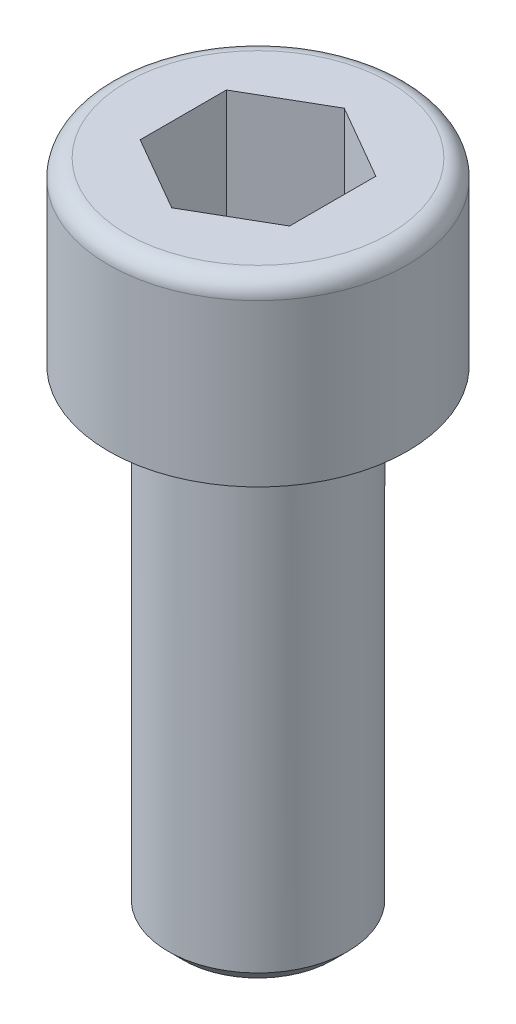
from build123d import *

# Parameters (mm, degrees)
CHANFREIN1_SIZE = 0.5
EMPREINTE_DEPTH = 4.32


with BuildPart() as part:
    # E_corps → corps (revolve)
    with BuildSketch(Plane.XY, mode=Mode.PRIVATE) as corps_sk:
        with BuildLine():
            Line((3, -6), (5, -6))
            Line((5, -6), (5, -0.6))
            ThreePointArc((5, -0.6), (4.824264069, -0.175735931), (4.4, 0))
            Line((4.4, 0), (0, 0))
            Line((0, 0), (0, -22))
            Line((0, -22), (3, -22))
            Line((3, -22), (3, -6))
        make_face()
    revolve(corps_sk.sketch.rotate(Axis((0, 65.117292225, 0), (0, -1, 0)), 180), axis=Axis((0, 65.117292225, 0), (0, -1, 0)))

    # Chanfrein1
    chanfrein1_edges = [part.edges().sort_by_distance(p)[0] for p in [
        (3, -22, 0),
    ]]
    chamfer(chanfrein1_edges, length=CHANFREIN1_SIZE)

    # E_empreinte → Empreinte (cut)
    with BuildSketch(Plane(origin=(0, 0, 0), x_dir=(-1, 0, 0), z_dir=(0, 1, 0))):
        Polygon((0, -2.886751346), (-2.5, -1.443375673), (-2.5, 1.443375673), (0, 2.886751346), (2.5, 1.443375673), (2.5, -1.443375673), align=None)
    extrude(amount=-EMPREINTE_DEPTH, mode=Mode.SUBTRACT)

    # Esquisse2 → Enlever de la mati_re-lisser1 section 0
    with BuildSketch(Plane(origin=(0, -4.32, 0), x_dir=(-1, 0, 0), z_dir=(0, 1, 0)), mode=Mode.PRIVATE) as enlever_de_la_mati_re_lisser1_s0:
        with BuildLine():
            Line((0, -2.886751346), (2.5, -1.443375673))
            Line((2.5, -1.443375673), (2.5, 1.443375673))
            Line((2.5, 1.443375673), (0, 2.886751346))
            Line((0, 2.886751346), (-2.5, 1.443375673))
            Line((-2.5, 1.443375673), (-2.5, -1.443375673))
            Line((-2.5, -1.443375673), (0, -2.886751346))
        make_face()
    loft([Vertex(0, -4.8, 0), enlever_de_la_mati_re_lisser1_s0.sketch], mode=Mode.SUBTRACT)


solid = part.part
